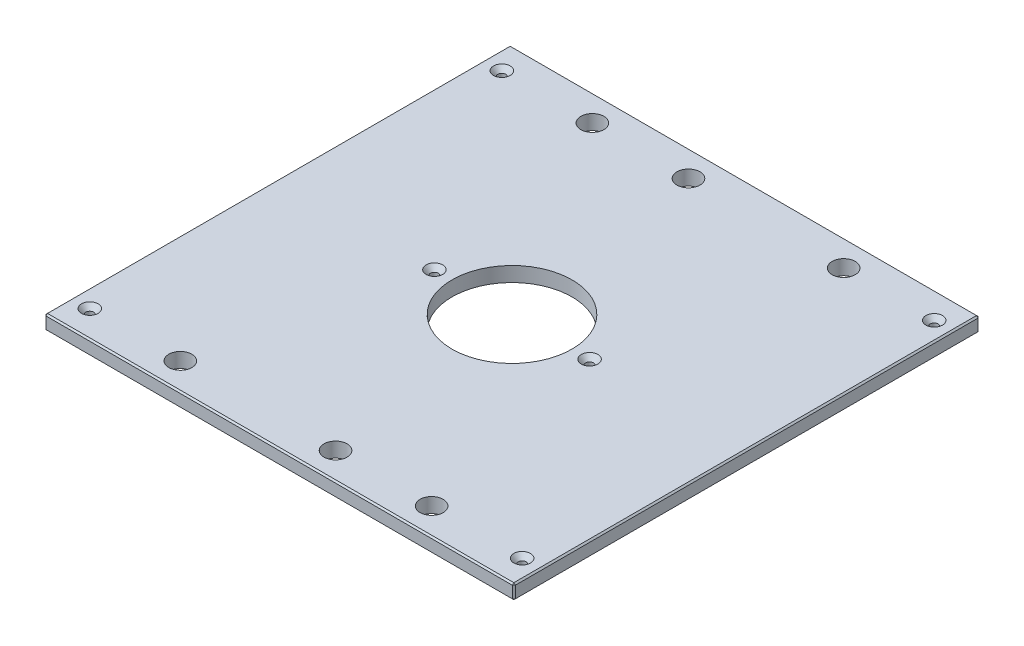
from build123d import *

# Parameters (mm, degrees)
SKETCH1_W                                        = 403.225
SKETCH1_H                                        = 400.05
BOSS_EXTRUDE1_DEPTH                              = 12.7
SKETCH13_R                                       = 51.562
CUT_EXTRUDE6_DEPTH                               = 285.286634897
F_25_32_0_78125_DIAMETER_HOLE1_D                 = 19.84375
CHAMFER2_SIZE                                    = 1.27
CSK_FOR_1_4_FLAT_HEAD_MACHINE_SCREW1_D           = 6.7564
CSK_FOR_1_4_FLAT_HEAD_MACHINE_SCREW1_CSINK_D     = 14.2748
CSK_FOR_1_4_FLAT_HEAD_MACHINE_SCREW1_CSINK_ANGLE = 82


with BuildPart() as part:
    # Sketch1 → Boss-Extrude1 (new body)
    with BuildSketch(Plane(origin=(0, 0, 0), x_dir=(1, 0, 0), z_dir=(0, 1, 0))):
        Rectangle(SKETCH1_W, SKETCH1_H)
    extrude(amount=BOSS_EXTRUDE1_DEPTH)

    # Sketch13 → Cut-Extrude6 (cut, through all)
    with BuildSketch(Plane(origin=(0, 12.7, 0), x_dir=(1, 0, 0), z_dir=(0, 1, 0))):
        with Locations(Location((0, 0, 0), (0, 0, 270))):
            Circle(SKETCH13_R)
    extrude(amount=-CUT_EXTRUDE6_DEPTH, mode=Mode.SUBTRACT)

    # 25_32 _0.78125_ Diameter Hole1 (through all)
    with Locations(Plane(origin=(0, 12.7, 0), x_dir=(1, 0, 0), z_dir=(0, 1, 0))):
        with Locations((107.95, 177.00498), (-107.95, 177.00498), (107.95, -177.00498), (-107.95, -177.00498), (-25.4, 177.00498), (25.4, -177.00498)):
            Hole(F_25_32_0_78125_DIAMETER_HOLE1_D / 2)

    # Chamfer2
    chamfer2_edges = [part.edges().sort_by_distance(p)[0] for p in [
        (201.6125, 12.7, 0),
        (0, 12.7, -200.025),
        (-201.6125, 12.7, 0),
        (0, 0, -200.025),
        (201.6125, 0, 0),
        (0, 0, 200.025),
        (-201.6125, 0, 0),
        (0, 12.7, 200.025),
        (-201.6125, 6.35, -200.025),
        (201.6125, 6.35, -200.025),
        (201.6125, 6.35, 200.025),
        (-201.6125, 6.35, 200.025),
    ]]
    chamfer(chamfer2_edges, length=CHAMFER2_SIZE)

    # CSK for 1_4 Flat Head Machine Screw1 (through all)
    with Locations(Plane(origin=(0, 12.7, 0), x_dir=(1, 0, 0), z_dir=(0, 1, 0))):
        with Locations((185.7375, 177.00498), (185.7375, -177.00498), (-185.7375, -177.00498), (-66.675, 0), (66.675, 0), (-185.7375, 177.00498), (-107.95, 177.00498), (-107.95, -177.00498)):
            CounterSinkHole(CSK_FOR_1_4_FLAT_HEAD_MACHINE_SCREW1_D / 2, CSK_FOR_1_4_FLAT_HEAD_MACHINE_SCREW1_CSINK_D / 2, counter_sink_angle=CSK_FOR_1_4_FLAT_HEAD_MACHINE_SCREW1_CSINK_ANGLE)


solid = part.part
